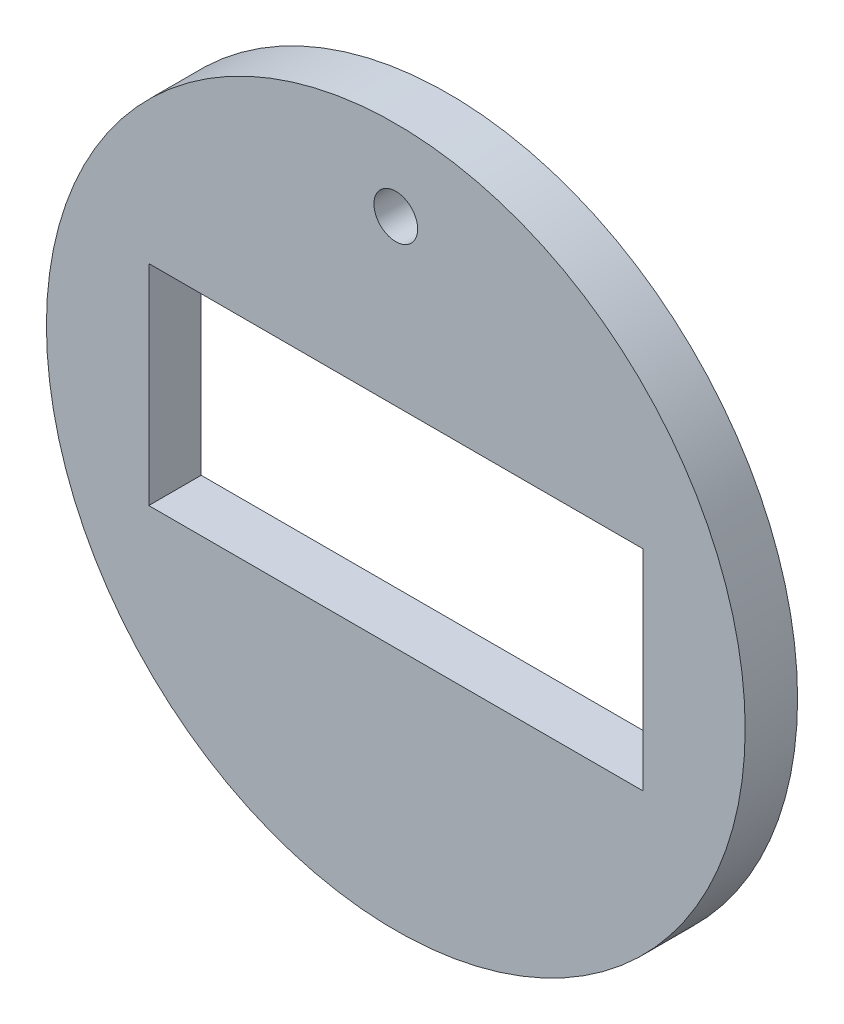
from build123d import *

# Parameters (mm, degrees)
SKETCH1_R          = 25.4
EXTRUDE1_DEPTH     = 3.81
SKETCH2_R          = 1.5875
CUT_EXTRUDE1_DEPTH = 37.122515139
SKETCH3_W          = 35.9156
SKETCH3_H          = 15.24
CUT_EXTRUDE2_DEPTH = 37.122515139


with BuildPart() as part:
    # Sketch1 → Extrude1 (new body)
    with BuildSketch(Plane.XY):
        with Locations(Location((0, 0, 0), (0, 0, 180))):
            Circle(SKETCH1_R)
    extrude(amount=EXTRUDE1_DEPTH)

    # Sketch2 → Cut-Extrude1 (cut, through all)
    with BuildSketch(Plane.XY):
        with Locations(Location((0, 19.558, 0), (0, 0, 180))):
            Circle(SKETCH2_R)
    extrude(amount=CUT_EXTRUDE1_DEPTH, mode=Mode.SUBTRACT)

    # Sketch3 → Cut-Extrude2 (cut, through all)
    with BuildSketch(Plane.XY):
        Rectangle(SKETCH3_W, SKETCH3_H)
    extrude(amount=CUT_EXTRUDE2_DEPTH, mode=Mode.SUBTRACT)


solid = part.part
